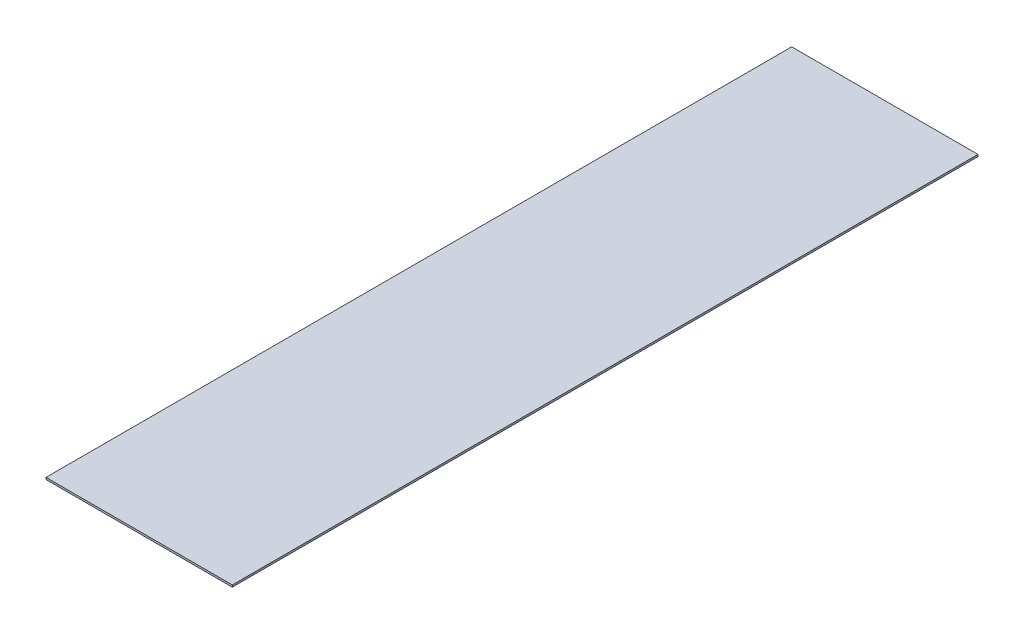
from build123d import *

# Parameters (mm, degrees)
SKETCH1_W           = 609.6
SKETCH1_H           = 2439.9875
BOSS_EXTRUDE1_DEPTH = 6.35


with BuildPart() as part:
    # Sketch1 → Boss-Extrude1 (new body)
    with BuildSketch(Plane(origin=(0, 0, 0), x_dir=(1, 0, 0), z_dir=(0, 1, 0))):
        Rectangle(SKETCH1_W, SKETCH1_H)
    extrude(amount=BOSS_EXTRUDE1_DEPTH)


solid = part.part
